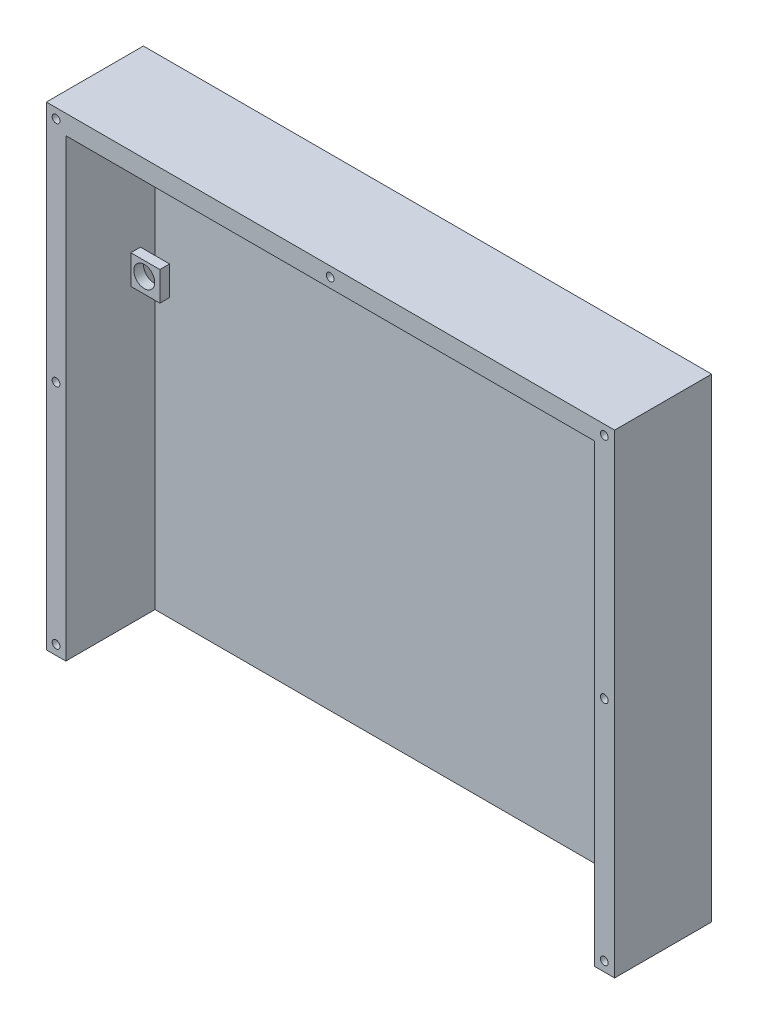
ISO-10303-21;
HEADER;
FILE_DESCRIPTION(('STEP AP214'),'2;1');
FILE_NAME('part.step','',(''),(''),'','','');
FILE_SCHEMA(('AUTOMOTIVE_DESIGN { 1 0 10303 214 1 1 1 1 }'));
ENDSEC;
DATA;
#1=APPLICATION_CONTEXT('core data for automotive mechanical design processes');
#2=APPLICATION_PROTOCOL_DEFINITION('international standard','automotive_design',2000,#1);
#3=PRODUCT_CONTEXT('',#1,'mechanical');
#4=PRODUCT('Part','Part','',(#3));
#5=PRODUCT_RELATED_PRODUCT_CATEGORY('part','',(#4));
#6=PRODUCT_DEFINITION_FORMATION('','',#4);
#7=PRODUCT_DEFINITION_CONTEXT('part definition',#1,'design');
#8=PRODUCT_DEFINITION('design','',#6,#7);
#9=PRODUCT_DEFINITION_SHAPE('','',#8);
#10=(LENGTH_UNIT() NAMED_UNIT(*) SI_UNIT(.MILLI.,.METRE.));
#11=(NAMED_UNIT(*) PLANE_ANGLE_UNIT() SI_UNIT($,.RADIAN.));
#12=(NAMED_UNIT(*) SI_UNIT($,.STERADIAN.) SOLID_ANGLE_UNIT());
#13=UNCERTAINTY_MEASURE_WITH_UNIT(LENGTH_MEASURE(1.E-05),#10,'distance_accuracy_value','');
#14=(GEOMETRIC_REPRESENTATION_CONTEXT(3) GLOBAL_UNCERTAINTY_ASSIGNED_CONTEXT((#13)) GLOBAL_UNIT_ASSIGNED_CONTEXT((#10,
#11,#12)) REPRESENTATION_CONTEXT('',''));
#15=CARTESIAN_POINT('',(0.,0.,0.));
#16=DIRECTION('',(0.,0.,1.));
#17=DIRECTION('',(1.,0.,0.));
#18=AXIS2_PLACEMENT_3D('',#15,#16,#17);
#19=CARTESIAN_POINT('',(10.,479.,0.));
#20=DIRECTION('',(0.,0.,1.));
#21=DIRECTION('',(1.,0.,0.));
#22=AXIS2_PLACEMENT_3D('',#19,#20,#21);
#23=CYLINDRICAL_SURFACE('',#22,4.);
#24=CARTESIAN_POINT('',(10.,479.,100.));
#25=DIRECTION('',(0.,0.,1.));
#26=DIRECTION('',(1.,0.,0.));
#27=AXIS2_PLACEMENT_3D('',#24,#25,#26);
#28=CIRCLE('',#27,4.);
#29=CARTESIAN_POINT('',(14.,479.,100.));
#30=VERTEX_POINT('',#29);
#31=EDGE_CURVE('E287',#30,#30,#28,.T.);
#32=ORIENTED_EDGE('',*,*,#31,.T.);
#33=EDGE_LOOP('',(#32));
#34=FACE_BOUND('',#33,.T.);
#35=CARTESIAN_POINT('',(10.,479.,4.));
#36=DIRECTION('',(0.,0.,-1.));
#37=DIRECTION('',(-1.,0.,0.));
#38=AXIS2_PLACEMENT_3D('',#35,#36,#37);
#39=CIRCLE('',#38,4.);
#40=CARTESIAN_POINT('',(6.,479.,4.));
#41=VERTEX_POINT('',#40);
#42=EDGE_CURVE('E43',#41,#41,#39,.F.);
#43=ORIENTED_EDGE('',*,*,#42,.F.);
#44=EDGE_LOOP('',(#43));
#45=FACE_BOUND('',#44,.T.);
#46=ADVANCED_FACE('F39',(#34,#45),#23,.F.);
#47=CARTESIAN_POINT('',(292.5,479.,0.));
#48=DIRECTION('',(0.,0.,1.));
#49=DIRECTION('',(1.,0.,0.));
#50=AXIS2_PLACEMENT_3D('',#47,#48,#49);
#51=CYLINDRICAL_SURFACE('',#50,3.99999999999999);
#52=CARTESIAN_POINT('',(292.5,479.,100.));
#53=DIRECTION('',(0.,0.,1.));
#54=DIRECTION('',(1.,0.,0.));
#55=AXIS2_PLACEMENT_3D('',#52,#53,#54);
#56=CIRCLE('',#55,3.99999999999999);
#57=CARTESIAN_POINT('',(296.5,479.,100.));
#58=VERTEX_POINT('',#57);
#59=EDGE_CURVE('E260',#58,#58,#56,.T.);
#60=ORIENTED_EDGE('',*,*,#59,.T.);
#61=EDGE_LOOP('',(#60));
#62=FACE_BOUND('',#61,.T.);
#63=CARTESIAN_POINT('',(292.5,479.,4.));
#64=DIRECTION('',(0.,0.,-1.));
#65=DIRECTION('',(-1.,0.,0.));
#66=AXIS2_PLACEMENT_3D('',#63,#64,#65);
#67=CIRCLE('',#66,3.99999999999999);
#68=CARTESIAN_POINT('',(288.5,479.,4.));
#69=VERTEX_POINT('',#68);
#70=EDGE_CURVE('E253',#69,#69,#67,.F.);
#71=ORIENTED_EDGE('',*,*,#70,.F.);
#72=EDGE_LOOP('',(#71));
#73=FACE_BOUND('',#72,.T.);
#74=ADVANCED_FACE('F376',(#62,#73),#51,.F.);
#75=CARTESIAN_POINT('',(575.,244.,0.));
#76=DIRECTION('',(0.,0.,1.));
#77=DIRECTION('',(1.,0.,0.));
#78=AXIS2_PLACEMENT_3D('',#75,#76,#77);
#79=CYLINDRICAL_SURFACE('',#78,3.99999999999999);
#80=CARTESIAN_POINT('',(575.,244.,100.));
#81=DIRECTION('',(0.,0.,1.));
#82=DIRECTION('',(1.,0.,0.));
#83=AXIS2_PLACEMENT_3D('',#80,#81,#82);
#84=CIRCLE('',#83,3.99999999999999);
#85=CARTESIAN_POINT('',(579.,244.,100.));
#86=VERTEX_POINT('',#85);
#87=EDGE_CURVE('E265',#86,#86,#84,.T.);
#88=ORIENTED_EDGE('',*,*,#87,.T.);
#89=EDGE_LOOP('',(#88));
#90=FACE_BOUND('',#89,.T.);
#91=CARTESIAN_POINT('',(575.,244.,4.));
#92=DIRECTION('',(0.,0.,-1.));
#93=DIRECTION('',(-1.,0.,0.));
#94=AXIS2_PLACEMENT_3D('',#91,#92,#93);
#95=CIRCLE('',#94,3.99999999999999);
#96=CARTESIAN_POINT('',(571.,244.,4.));
#97=VERTEX_POINT('',#96);
#98=EDGE_CURVE('E250',#97,#97,#95,.F.);
#99=ORIENTED_EDGE('',*,*,#98,.F.);
#100=EDGE_LOOP('',(#99));
#101=FACE_BOUND('',#100,.T.);
#102=ADVANCED_FACE('F382',(#90,#101),#79,.F.);
#103=CARTESIAN_POINT('',(575.,479.,0.));
#104=DIRECTION('',(0.,0.,1.));
#105=DIRECTION('',(1.,0.,0.));
#106=AXIS2_PLACEMENT_3D('',#103,#104,#105);
#107=CYLINDRICAL_SURFACE('',#106,3.99999999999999);
#108=CARTESIAN_POINT('',(575.,479.,100.));
#109=DIRECTION('',(0.,0.,1.));
#110=DIRECTION('',(1.,0.,0.));
#111=AXIS2_PLACEMENT_3D('',#108,#109,#110);
#112=CIRCLE('',#111,3.99999999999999);
#113=CARTESIAN_POINT('',(579.,479.,100.));
#114=VERTEX_POINT('',#113);
#115=EDGE_CURVE('E283',#114,#114,#112,.T.);
#116=ORIENTED_EDGE('',*,*,#115,.T.);
#117=EDGE_LOOP('',(#116));
#118=FACE_BOUND('',#117,.T.);
#119=CARTESIAN_POINT('',(575.,479.,4.));
#120=DIRECTION('',(0.,0.,-1.));
#121=DIRECTION('',(-1.,0.,0.));
#122=AXIS2_PLACEMENT_3D('',#119,#120,#121);
#123=CIRCLE('',#122,3.99999999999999);
#124=CARTESIAN_POINT('',(571.,479.,4.));
#125=VERTEX_POINT('',#124);
#126=EDGE_CURVE('E246',#125,#125,#123,.F.);
#127=ORIENTED_EDGE('',*,*,#126,.F.);
#128=EDGE_LOOP('',(#127));
#129=FACE_BOUND('',#128,.T.);
#130=ADVANCED_FACE('F439',(#118,#129),#107,.F.);
#131=CARTESIAN_POINT('',(10.,10.,0.));
#132=DIRECTION('',(0.,0.,1.));
#133=DIRECTION('',(1.,0.,0.));
#134=AXIS2_PLACEMENT_3D('',#131,#132,#133);
#135=CYLINDRICAL_SURFACE('',#134,4.);
#136=CARTESIAN_POINT('',(10.,10.,100.));
#137=DIRECTION('',(0.,0.,1.));
#138=DIRECTION('',(1.,0.,0.));
#139=AXIS2_PLACEMENT_3D('',#136,#137,#138);
#140=CIRCLE('',#139,4.);
#141=CARTESIAN_POINT('',(14.,10.,100.));
#142=VERTEX_POINT('',#141);
#143=EDGE_CURVE('E279',#142,#142,#140,.T.);
#144=ORIENTED_EDGE('',*,*,#143,.T.);
#145=EDGE_LOOP('',(#144));
#146=FACE_BOUND('',#145,.T.);
#147=CARTESIAN_POINT('',(10.,10.,4.));
#148=DIRECTION('',(0.,0.,-1.));
#149=DIRECTION('',(-1.,0.,0.));
#150=AXIS2_PLACEMENT_3D('',#147,#148,#149);
#151=CIRCLE('',#150,4.);
#152=CARTESIAN_POINT('',(6.,10.,4.));
#153=VERTEX_POINT('',#152);
#154=EDGE_CURVE('E242',#153,#153,#151,.F.);
#155=ORIENTED_EDGE('',*,*,#154,.F.);
#156=EDGE_LOOP('',(#155));
#157=FACE_BOUND('',#156,.T.);
#158=ADVANCED_FACE('F387',(#146,#157),#135,.F.);
#159=CARTESIAN_POINT('',(575.,10.,0.));
#160=DIRECTION('',(0.,0.,1.));
#161=DIRECTION('',(1.,0.,0.));
#162=AXIS2_PLACEMENT_3D('',#159,#160,#161);
#163=CYLINDRICAL_SURFACE('',#162,3.99999999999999);
#164=CARTESIAN_POINT('',(575.,10.,100.));
#165=DIRECTION('',(0.,0.,1.));
#166=DIRECTION('',(1.,0.,0.));
#167=AXIS2_PLACEMENT_3D('',#164,#165,#166);
#168=CIRCLE('',#167,3.99999999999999);
#169=CARTESIAN_POINT('',(579.,10.,100.));
#170=VERTEX_POINT('',#169);
#171=EDGE_CURVE('E275',#170,#170,#168,.T.);
#172=ORIENTED_EDGE('',*,*,#171,.T.);
#173=EDGE_LOOP('',(#172));
#174=FACE_BOUND('',#173,.T.);
#175=CARTESIAN_POINT('',(575.,10.,4.));
#176=DIRECTION('',(0.,0.,-1.));
#177=DIRECTION('',(-1.,0.,0.));
#178=AXIS2_PLACEMENT_3D('',#175,#176,#177);
#179=CIRCLE('',#178,3.99999999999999);
#180=CARTESIAN_POINT('',(571.,10.,4.));
#181=VERTEX_POINT('',#180);
#182=EDGE_CURVE('E237',#181,#181,#179,.F.);
#183=ORIENTED_EDGE('',*,*,#182,.F.);
#184=EDGE_LOOP('',(#183));
#185=FACE_BOUND('',#184,.T.);
#186=ADVANCED_FACE('F421',(#174,#185),#163,.F.);
#187=CARTESIAN_POINT('',(10.,244.,0.));
#188=DIRECTION('',(0.,0.,1.));
#189=DIRECTION('',(1.,0.,0.));
#190=AXIS2_PLACEMENT_3D('',#187,#188,#189);
#191=CYLINDRICAL_SURFACE('',#190,4.);
#192=CARTESIAN_POINT('',(10.,244.,100.));
#193=DIRECTION('',(0.,0.,1.));
#194=DIRECTION('',(1.,0.,0.));
#195=AXIS2_PLACEMENT_3D('',#192,#193,#194);
#196=CIRCLE('',#195,4.);
#197=CARTESIAN_POINT('',(14.,244.,100.));
#198=VERTEX_POINT('',#197);
#199=EDGE_CURVE('E271',#198,#198,#196,.T.);
#200=ORIENTED_EDGE('',*,*,#199,.T.);
#201=EDGE_LOOP('',(#200));
#202=FACE_BOUND('',#201,.T.);
#203=CARTESIAN_POINT('',(10.,244.,4.));
#204=DIRECTION('',(0.,0.,-1.));
#205=DIRECTION('',(-1.,0.,0.));
#206=AXIS2_PLACEMENT_3D('',#203,#204,#205);
#207=CIRCLE('',#206,4.);
#208=CARTESIAN_POINT('',(6.,244.,4.));
#209=VERTEX_POINT('',#208);
#210=EDGE_CURVE('E233',#209,#209,#207,.F.);
#211=ORIENTED_EDGE('',*,*,#210,.F.);
#212=EDGE_LOOP('',(#211));
#213=FACE_BOUND('',#212,.T.);
#214=ADVANCED_FACE('F415',(#202,#213),#191,.F.);
#215=CARTESIAN_POINT('',(0.,0.,100.));
#216=DIRECTION('',(0.,0.,-1.));
#217=DIRECTION('',(-1.,0.,0.));
#218=AXIS2_PLACEMENT_3D('',#215,#216,#217);
#219=PLANE('',#218);
#220=ORIENTED_EDGE('',*,*,#199,.F.);
#221=EDGE_LOOP('',(#220));
#222=FACE_BOUND('',#221,.T.);
#223=ORIENTED_EDGE('',*,*,#171,.F.);
#224=EDGE_LOOP('',(#223));
#225=FACE_BOUND('',#224,.T.);
#226=ORIENTED_EDGE('',*,*,#143,.F.);
#227=EDGE_LOOP('',(#226));
#228=FACE_BOUND('',#227,.T.);
#229=ORIENTED_EDGE('',*,*,#115,.F.);
#230=EDGE_LOOP('',(#229));
#231=FACE_BOUND('',#230,.T.);
#232=ORIENTED_EDGE('',*,*,#87,.F.);
#233=EDGE_LOOP('',(#232));
#234=FACE_BOUND('',#233,.T.);
#235=ORIENTED_EDGE('',*,*,#59,.F.);
#236=EDGE_LOOP('',(#235));
#237=FACE_BOUND('',#236,.T.);
#238=ORIENTED_EDGE('',*,*,#31,.F.);
#239=EDGE_LOOP('',(#238));
#240=FACE_BOUND('',#239,.T.);
#241=DIRECTION('',(1.,0.,0.));
#242=VECTOR('',#241,1.);
#243=CARTESIAN_POINT('',(0.,0.,100.));
#244=LINE('',#243,#242);
#245=CARTESIAN_POINT('',(0.,0.,100.));
#246=VERTEX_POINT('',#245);
#247=CARTESIAN_POINT('',(20.,0.,100.));
#248=VERTEX_POINT('',#247);
#249=EDGE_CURVE('E201',#246,#248,#244,.T.);
#250=ORIENTED_EDGE('',*,*,#249,.T.);
#251=DIRECTION('',(0.,-1.,0.));
#252=VECTOR('',#251,1.);
#253=CARTESIAN_POINT('',(19.9999999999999,469.,100.));
#254=LINE('',#253,#252);
#255=CARTESIAN_POINT('',(19.9999999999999,469.,100.));
#256=VERTEX_POINT('',#255);
#257=EDGE_CURVE('E163',#256,#248,#254,.T.);
#258=ORIENTED_EDGE('',*,*,#257,.F.);
#259=DIRECTION('',(-1.,0.,0.));
#260=VECTOR('',#259,1.);
#261=CARTESIAN_POINT('',(50.,469.,100.));
#262=LINE('',#261,#260);
#263=CARTESIAN_POINT('',(565.,469.,100.));
#264=VERTEX_POINT('',#263);
#265=EDGE_CURVE('E176',#264,#256,#262,.T.);
#266=ORIENTED_EDGE('',*,*,#265,.F.);
#267=DIRECTION('',(0.,1.,0.));
#268=VECTOR('',#267,1.);
#269=CARTESIAN_POINT('',(565.,469.,100.));
#270=LINE('',#269,#268);
#271=CARTESIAN_POINT('',(565.,0.,100.));
#272=VERTEX_POINT('',#271);
#273=EDGE_CURVE('E183',#272,#264,#270,.T.);
#274=ORIENTED_EDGE('',*,*,#273,.F.);
#275=CARTESIAN_POINT('',(585.633745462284,0.,100.));
#276=VERTEX_POINT('',#275);
#277=EDGE_CURVE('E199',#272,#276,#244,.T.);
#278=ORIENTED_EDGE('',*,*,#277,.T.);
#279=DIRECTION('',(0.,1.,0.));
#280=VECTOR('',#279,1.);
#281=CARTESIAN_POINT('',(585.633745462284,0.,100.));
#282=LINE('',#281,#280);
#283=CARTESIAN_POINT('',(585.633745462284,489.,100.));
#284=VERTEX_POINT('',#283);
#285=EDGE_CURVE('E205',#276,#284,#282,.T.);
#286=ORIENTED_EDGE('',*,*,#285,.T.);
#287=DIRECTION('',(-1.,0.,0.));
#288=VECTOR('',#287,1.);
#289=CARTESIAN_POINT('',(0.,489.,100.));
#290=LINE('',#289,#288);
#291=CARTESIAN_POINT('',(0.,489.,100.));
#292=VERTEX_POINT('',#291);
#293=EDGE_CURVE('E208',#284,#292,#290,.T.);
#294=ORIENTED_EDGE('',*,*,#293,.T.);
#295=DIRECTION('',(0.,-1.,0.));
#296=VECTOR('',#295,1.);
#297=CARTESIAN_POINT('',(0.,0.,100.));
#298=LINE('',#297,#296);
#299=EDGE_CURVE('E195',#292,#246,#298,.T.);
#300=ORIENTED_EDGE('',*,*,#299,.T.);
#301=EDGE_LOOP('',(#250,#258,#266,#274,#278,#286,#294,#300));
#302=FACE_BOUND('',#301,.T.);
#303=ADVANCED_FACE('F334',(#222,#225,#228,#231,#234,#237,#240,#302),#219,.F.);
#304=CARTESIAN_POINT('',(0.,0.,100.));
#305=DIRECTION('',(1.,0.,0.));
#306=DIRECTION('',(0.,0.,-1.));
#307=AXIS2_PLACEMENT_3D('',#304,#305,#306);
#308=PLANE('',#307);
#309=DIRECTION('',(0.,-1.,0.));
#310=VECTOR('',#309,1.);
#311=CARTESIAN_POINT('',(0.,0.,0.));
#312=LINE('',#311,#310);
#313=CARTESIAN_POINT('',(0.,489.,0.));
#314=VERTEX_POINT('',#313);
#315=CARTESIAN_POINT('',(0.,0.,0.));
#316=VERTEX_POINT('',#315);
#317=EDGE_CURVE('E192',#314,#316,#312,.T.);
#318=ORIENTED_EDGE('',*,*,#317,.T.);
#319=DIRECTION('',(0.,0.,-1.));
#320=VECTOR('',#319,1.);
#321=CARTESIAN_POINT('',(0.,0.,100.));
#322=LINE('',#321,#320);
#323=EDGE_CURVE('E11',#246,#316,#322,.T.);
#324=ORIENTED_EDGE('',*,*,#323,.F.);
#325=ORIENTED_EDGE('',*,*,#299,.F.);
#326=DIRECTION('',(0.,0.,-1.));
#327=VECTOR('',#326,1.);
#328=CARTESIAN_POINT('',(0.,489.,100.));
#329=LINE('',#328,#327);
#330=EDGE_CURVE('E211',#292,#314,#329,.T.);
#331=ORIENTED_EDGE('',*,*,#330,.T.);
#332=EDGE_LOOP('',(#318,#324,#325,#331));
#333=FACE_BOUND('',#332,.T.);
#334=ADVANCED_FACE('F41',(#333),#308,.F.);
#335=CARTESIAN_POINT('',(0.,0.,100.));
#336=DIRECTION('',(0.,1.,0.));
#337=DIRECTION('',(0.,0.,1.));
#338=AXIS2_PLACEMENT_3D('',#335,#336,#337);
#339=PLANE('',#338);
#340=DIRECTION('',(1.,0.,0.));
#341=VECTOR('',#340,1.);
#342=CARTESIAN_POINT('',(50.,0.,8.00000000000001));
#343=LINE('',#342,#341);
#344=CARTESIAN_POINT('',(20.,0.,7.99999999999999));
#345=VERTEX_POINT('',#344);
#346=CARTESIAN_POINT('',(565.,0.,8.00000000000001));
#347=VERTEX_POINT('',#346);
#348=EDGE_CURVE('E171',#345,#347,#343,.T.);
#349=ORIENTED_EDGE('',*,*,#348,.F.);
#350=DIRECTION('',(0.,0.,-1.));
#351=VECTOR('',#350,1.);
#352=CARTESIAN_POINT('',(20.,0.,100.));
#353=LINE('',#352,#351);
#354=EDGE_CURVE('E158',#248,#345,#353,.T.);
#355=ORIENTED_EDGE('',*,*,#354,.F.);
#356=ORIENTED_EDGE('',*,*,#249,.F.);
#357=ORIENTED_EDGE('',*,*,#323,.T.);
#358=DIRECTION('',(1.,0.,0.));
#359=VECTOR('',#358,1.);
#360=CARTESIAN_POINT('',(0.,0.,0.));
#361=LINE('',#360,#359);
#362=CARTESIAN_POINT('',(585.633745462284,0.,0.));
#363=VERTEX_POINT('',#362);
#364=EDGE_CURVE('E215',#316,#363,#361,.T.);
#365=ORIENTED_EDGE('',*,*,#364,.T.);
#366=DIRECTION('',(0.,0.,-1.));
#367=VECTOR('',#366,1.);
#368=CARTESIAN_POINT('',(585.633745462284,0.,100.));
#369=LINE('',#368,#367);
#370=EDGE_CURVE('E49',#276,#363,#369,.T.);
#371=ORIENTED_EDGE('',*,*,#370,.F.);
#372=ORIENTED_EDGE('',*,*,#277,.F.);
#373=DIRECTION('',(0.,0.,1.));
#374=VECTOR('',#373,1.);
#375=CARTESIAN_POINT('',(565.,0.,8.00000000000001));
#376=LINE('',#375,#374);
#377=EDGE_CURVE('E65',#347,#272,#376,.T.);
#378=ORIENTED_EDGE('',*,*,#377,.F.);
#379=EDGE_LOOP('',(#349,#355,#356,#357,#365,#371,#372,#378));
#380=FACE_BOUND('',#379,.T.);
#381=ADVANCED_FACE('F339',(#380),#339,.F.);
#382=CARTESIAN_POINT('',(585.633745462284,0.,100.));
#383=DIRECTION('',(-1.,0.,0.));
#384=DIRECTION('',(0.,0.,1.));
#385=AXIS2_PLACEMENT_3D('',#382,#383,#384);
#386=PLANE('',#385);
#387=DIRECTION('',(0.,1.,0.));
#388=VECTOR('',#387,1.);
#389=CARTESIAN_POINT('',(585.633745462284,0.,0.));
#390=LINE('',#389,#388);
#391=CARTESIAN_POINT('',(585.633745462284,489.,0.));
#392=VERTEX_POINT('',#391);
#393=EDGE_CURVE('E218',#363,#392,#390,.T.);
#394=ORIENTED_EDGE('',*,*,#393,.T.);
#395=DIRECTION('',(0.,0.,-1.));
#396=VECTOR('',#395,1.);
#397=CARTESIAN_POINT('',(585.633745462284,489.,100.));
#398=LINE('',#397,#396);
#399=EDGE_CURVE('E226',#284,#392,#398,.T.);
#400=ORIENTED_EDGE('',*,*,#399,.F.);
#401=ORIENTED_EDGE('',*,*,#285,.F.);
#402=ORIENTED_EDGE('',*,*,#370,.T.);
#403=EDGE_LOOP('',(#394,#400,#401,#402));
#404=FACE_BOUND('',#403,.T.);
#405=ADVANCED_FACE('F351',(#404),#386,.F.);
#406=CARTESIAN_POINT('',(0.,489.,100.));
#407=DIRECTION('',(0.,-1.,0.));
#408=DIRECTION('',(0.,0.,-1.));
#409=AXIS2_PLACEMENT_3D('',#406,#407,#408);
#410=PLANE('',#409);
#411=DIRECTION('',(-1.,0.,0.));
#412=VECTOR('',#411,1.);
#413=CARTESIAN_POINT('',(0.,489.,0.));
#414=LINE('',#413,#412);
#415=EDGE_CURVE('E200',#392,#314,#414,.T.);
#416=ORIENTED_EDGE('',*,*,#415,.T.);
#417=ORIENTED_EDGE('',*,*,#330,.F.);
#418=ORIENTED_EDGE('',*,*,#293,.F.);
#419=ORIENTED_EDGE('',*,*,#399,.T.);
#420=EDGE_LOOP('',(#416,#417,#418,#419));
#421=FACE_BOUND('',#420,.T.);
#422=ADVANCED_FACE('F355',(#421),#410,.F.);
#423=CARTESIAN_POINT('',(0.,0.,0.));
#424=DIRECTION('',(0.,0.,-1.));
#425=DIRECTION('',(-1.,0.,0.));
#426=AXIS2_PLACEMENT_3D('',#423,#424,#425);
#427=PLANE('',#426);
#428=CARTESIAN_POINT('',(292.5,479.,0.));
#429=DIRECTION('',(0.,0.,-1.));
#430=DIRECTION('',(-1.,0.,0.));
#431=AXIS2_PLACEMENT_3D('',#428,#429,#430);
#432=CIRCLE('',#431,5.99999999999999);
#433=CARTESIAN_POINT('',(286.5,479.,0.));
#434=VERTEX_POINT('',#433);
#435=EDGE_CURVE('E523',#434,#434,#432,.T.);
#436=ORIENTED_EDGE('',*,*,#435,.F.);
#437=EDGE_LOOP('',(#436));
#438=FACE_BOUND('',#437,.T.);
#439=CARTESIAN_POINT('',(10.,479.,0.));
#440=DIRECTION('',(0.,0.,-1.));
#441=DIRECTION('',(-1.,0.,0.));
#442=AXIS2_PLACEMENT_3D('',#439,#440,#441);
#443=CIRCLE('',#442,6.);
#444=CARTESIAN_POINT('',(4.,479.,0.));
#445=VERTEX_POINT('',#444);
#446=EDGE_CURVE('E524',#445,#445,#443,.T.);
#447=ORIENTED_EDGE('',*,*,#446,.F.);
#448=EDGE_LOOP('',(#447));
#449=FACE_BOUND('',#448,.T.);
#450=CARTESIAN_POINT('',(575.,244.,0.));
#451=DIRECTION('',(0.,0.,-1.));
#452=DIRECTION('',(-1.,0.,0.));
#453=AXIS2_PLACEMENT_3D('',#450,#451,#452);
#454=CIRCLE('',#453,5.99999999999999);
#455=CARTESIAN_POINT('',(569.,244.,0.));
#456=VERTEX_POINT('',#455);
#457=EDGE_CURVE('E538',#456,#456,#454,.T.);
#458=ORIENTED_EDGE('',*,*,#457,.F.);
#459=EDGE_LOOP('',(#458));
#460=FACE_BOUND('',#459,.T.);
#461=CARTESIAN_POINT('',(575.,10.,0.));
#462=DIRECTION('',(0.,0.,-1.));
#463=DIRECTION('',(-1.,0.,0.));
#464=AXIS2_PLACEMENT_3D('',#461,#462,#463);
#465=CIRCLE('',#464,5.99999999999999);
#466=CARTESIAN_POINT('',(569.,10.,0.));
#467=VERTEX_POINT('',#466);
#468=EDGE_CURVE('E546',#467,#467,#465,.T.);
#469=ORIENTED_EDGE('',*,*,#468,.F.);
#470=EDGE_LOOP('',(#469));
#471=FACE_BOUND('',#470,.T.);
#472=CARTESIAN_POINT('',(10.,244.,0.));
#473=DIRECTION('',(0.,0.,-1.));
#474=DIRECTION('',(-1.,0.,0.));
#475=AXIS2_PLACEMENT_3D('',#472,#473,#474);
#476=CIRCLE('',#475,6.);
#477=CARTESIAN_POINT('',(4.,244.,0.));
#478=VERTEX_POINT('',#477);
#479=EDGE_CURVE('E569',#478,#478,#476,.T.);
#480=ORIENTED_EDGE('',*,*,#479,.F.);
#481=EDGE_LOOP('',(#480));
#482=FACE_BOUND('',#481,.T.);
#483=CARTESIAN_POINT('',(10.,10.,0.));
#484=DIRECTION('',(0.,0.,-1.));
#485=DIRECTION('',(-1.,0.,0.));
#486=AXIS2_PLACEMENT_3D('',#483,#484,#485);
#487=CIRCLE('',#486,6.);
#488=CARTESIAN_POINT('',(4.,10.,0.));
#489=VERTEX_POINT('',#488);
#490=EDGE_CURVE('E562',#489,#489,#487,.T.);
#491=ORIENTED_EDGE('',*,*,#490,.F.);
#492=EDGE_LOOP('',(#491));
#493=FACE_BOUND('',#492,.T.);
#494=CARTESIAN_POINT('',(575.,479.,0.));
#495=DIRECTION('',(0.,0.,-1.));
#496=DIRECTION('',(-1.,0.,0.));
#497=AXIS2_PLACEMENT_3D('',#494,#495,#496);
#498=CIRCLE('',#497,5.99999999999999);
#499=CARTESIAN_POINT('',(569.,479.,0.));
#500=VERTEX_POINT('',#499);
#501=EDGE_CURVE('E553',#500,#500,#498,.T.);
#502=ORIENTED_EDGE('',*,*,#501,.F.);
#503=EDGE_LOOP('',(#502));
#504=FACE_BOUND('',#503,.T.);
#505=ORIENTED_EDGE('',*,*,#317,.F.);
#506=ORIENTED_EDGE('',*,*,#415,.F.);
#507=ORIENTED_EDGE('',*,*,#393,.F.);
#508=ORIENTED_EDGE('',*,*,#364,.F.);
#509=EDGE_LOOP('',(#505,#506,#507,#508));
#510=FACE_BOUND('',#509,.T.);
#511=ADVANCED_FACE('F360',(#438,#449,#460,#471,#482,#493,#504,#510),#427,.T.);
#512=CARTESIAN_POINT('',(50.,469.,8.00000000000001));
#513=DIRECTION('',(-1.,0.,0.));
#514=DIRECTION('',(0.,-1.,0.));
#515=AXIS2_PLACEMENT_3D('',#512,#513,#514);
#516=PLANE('',#515);
#517=DIRECTION('',(0.,0.,1.));
#518=VECTOR('',#517,1.);
#519=CARTESIAN_POINT('',(50.,301.,100.));
#520=LINE('',#519,#518);
#521=CARTESIAN_POINT('',(50.,301.,23.));
#522=VERTEX_POINT('',#521);
#523=CARTESIAN_POINT('',(50.,301.,33.));
#524=VERTEX_POINT('',#523);
#525=EDGE_CURVE('E166',#522,#524,#520,.T.);
#526=ORIENTED_EDGE('',*,*,#525,.F.);
#527=DIRECTION('',(0.,-1.,0.));
#528=VECTOR('',#527,1.);
#529=CARTESIAN_POINT('',(50.,331.,23.));
#530=LINE('',#529,#528);
#531=CARTESIAN_POINT('',(50.,331.,23.));
#532=VERTEX_POINT('',#531);
#533=EDGE_CURVE('E138',#532,#522,#530,.T.);
#534=ORIENTED_EDGE('',*,*,#533,.F.);
#535=DIRECTION('',(0.,0.,-1.));
#536=VECTOR('',#535,1.);
#537=CARTESIAN_POINT('',(50.,331.,100.));
#538=LINE('',#537,#536);
#539=CARTESIAN_POINT('',(50.,331.,33.));
#540=VERTEX_POINT('',#539);
#541=EDGE_CURVE('E157',#540,#532,#538,.T.);
#542=ORIENTED_EDGE('',*,*,#541,.F.);
#543=DIRECTION('',(0.,1.,0.));
#544=VECTOR('',#543,1.);
#545=CARTESIAN_POINT('',(50.,331.,33.));
#546=LINE('',#545,#544);
#547=EDGE_CURVE('E299',#524,#540,#546,.T.);
#548=ORIENTED_EDGE('',*,*,#547,.F.);
#549=EDGE_LOOP('',(#526,#534,#542,#548));
#550=FACE_BOUND('',#549,.T.);
#551=ADVANCED_FACE('F362',(#550),#516,.F.);
#552=CARTESIAN_POINT('',(50.,469.,8.00000000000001));
#553=DIRECTION('',(0.,1.,0.));
#554=DIRECTION('',(0.,0.,1.));
#555=AXIS2_PLACEMENT_3D('',#552,#553,#554);
#556=PLANE('',#555);
#557=ORIENTED_EDGE('',*,*,#265,.T.);
#558=DIRECTION('',(0.,0.,1.));
#559=VECTOR('',#558,1.);
#560=CARTESIAN_POINT('',(19.9999999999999,469.,100.));
#561=LINE('',#560,#559);
#562=CARTESIAN_POINT('',(19.9999999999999,469.,7.99999999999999));
#563=VERTEX_POINT('',#562);
#564=EDGE_CURVE('E186',#563,#256,#561,.T.);
#565=ORIENTED_EDGE('',*,*,#564,.F.);
#566=DIRECTION('',(-1.,0.,0.));
#567=VECTOR('',#566,1.);
#568=CARTESIAN_POINT('',(50.,469.,8.00000000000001));
#569=LINE('',#568,#567);
#570=CARTESIAN_POINT('',(565.,469.,8.00000000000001));
#571=VERTEX_POINT('',#570);
#572=EDGE_CURVE('E180',#571,#563,#569,.T.);
#573=ORIENTED_EDGE('',*,*,#572,.F.);
#574=DIRECTION('',(0.,0.,1.));
#575=VECTOR('',#574,1.);
#576=CARTESIAN_POINT('',(565.,469.,8.00000000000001));
#577=LINE('',#576,#575);
#578=EDGE_CURVE('E189',#571,#264,#577,.T.);
#579=ORIENTED_EDGE('',*,*,#578,.T.);
#580=EDGE_LOOP('',(#557,#565,#573,#579));
#581=FACE_BOUND('',#580,.T.);
#582=ADVANCED_FACE('F343',(#581),#556,.F.);
#583=CARTESIAN_POINT('',(565.,469.,8.00000000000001));
#584=DIRECTION('',(1.,0.,0.));
#585=DIRECTION('',(0.,1.,0.));
#586=AXIS2_PLACEMENT_3D('',#583,#584,#585);
#587=PLANE('',#586);
#588=ORIENTED_EDGE('',*,*,#273,.T.);
#589=ORIENTED_EDGE('',*,*,#578,.F.);
#590=DIRECTION('',(0.,1.,0.));
#591=VECTOR('',#590,1.);
#592=CARTESIAN_POINT('',(565.,469.,8.00000000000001));
#593=LINE('',#592,#591);
#594=EDGE_CURVE('E175',#347,#571,#593,.T.);
#595=ORIENTED_EDGE('',*,*,#594,.F.);
#596=ORIENTED_EDGE('',*,*,#377,.T.);
#597=EDGE_LOOP('',(#588,#589,#595,#596));
#598=FACE_BOUND('',#597,.T.);
#599=ADVANCED_FACE('F344',(#598),#587,.F.);
#600=CARTESIAN_POINT('',(0.,0.,8.00000000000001));
#601=DIRECTION('',(0.,0.,1.));
#602=DIRECTION('',(1.,0.,0.));
#603=AXIS2_PLACEMENT_3D('',#600,#601,#602);
#604=PLANE('',#603);
#605=ORIENTED_EDGE('',*,*,#572,.T.);
#606=DIRECTION('',(0.,1.,0.));
#607=VECTOR('',#606,1.);
#608=CARTESIAN_POINT('',(19.9999999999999,469.,7.99999999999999));
#609=LINE('',#608,#607);
#610=EDGE_CURVE('E321',#345,#563,#609,.T.);
#611=ORIENTED_EDGE('',*,*,#610,.F.);
#612=ORIENTED_EDGE('',*,*,#348,.T.);
#613=ORIENTED_EDGE('',*,*,#594,.T.);
#614=EDGE_LOOP('',(#605,#611,#612,#613));
#615=FACE_BOUND('',#614,.T.);
#616=ADVANCED_FACE('F342',(#615),#604,.T.);
#617=CARTESIAN_POINT('',(20.,301.,100.));
#618=DIRECTION('',(0.,1.,0.));
#619=DIRECTION('',(-1.,0.,0.));
#620=AXIS2_PLACEMENT_3D('',#617,#618,#619);
#621=PLANE('',#620);
#622=DIRECTION('',(0.,0.,1.));
#623=VECTOR('',#622,1.);
#624=CARTESIAN_POINT('',(20.,301.,100.));
#625=LINE('',#624,#623);
#626=CARTESIAN_POINT('',(20.,301.,23.));
#627=VERTEX_POINT('',#626);
#628=CARTESIAN_POINT('',(20.,301.,33.));
#629=VERTEX_POINT('',#628);
#630=EDGE_CURVE('E148',#627,#629,#625,.T.);
#631=ORIENTED_EDGE('',*,*,#630,.F.);
#632=DIRECTION('',(1.,0.,0.));
#633=VECTOR('',#632,1.);
#634=CARTESIAN_POINT('',(20.,301.,23.));
#635=LINE('',#634,#633);
#636=EDGE_CURVE('E132',#627,#522,#635,.T.);
#637=ORIENTED_EDGE('',*,*,#636,.T.);
#638=ORIENTED_EDGE('',*,*,#525,.T.);
#639=DIRECTION('',(1.,0.,0.));
#640=VECTOR('',#639,1.);
#641=CARTESIAN_POINT('',(20.,301.,33.));
#642=LINE('',#641,#640);
#643=EDGE_CURVE('E155',#629,#524,#642,.T.);
#644=ORIENTED_EDGE('',*,*,#643,.F.);
#645=EDGE_LOOP('',(#631,#637,#638,#644));
#646=FACE_BOUND('',#645,.T.);
#647=ADVANCED_FACE('F154',(#646),#621,.F.);
#648=CARTESIAN_POINT('',(20.,331.,100.));
#649=DIRECTION('',(0.,-1.,0.));
#650=DIRECTION('',(1.,0.,0.));
#651=AXIS2_PLACEMENT_3D('',#648,#649,#650);
#652=PLANE('',#651);
#653=ORIENTED_EDGE('',*,*,#541,.T.);
#654=DIRECTION('',(1.,0.,0.));
#655=VECTOR('',#654,1.);
#656=CARTESIAN_POINT('',(20.,331.,23.));
#657=LINE('',#656,#655);
#658=CARTESIAN_POINT('',(20.,331.,23.));
#659=VERTEX_POINT('',#658);
#660=EDGE_CURVE('E144',#659,#532,#657,.T.);
#661=ORIENTED_EDGE('',*,*,#660,.F.);
#662=DIRECTION('',(0.,0.,-1.));
#663=VECTOR('',#662,1.);
#664=CARTESIAN_POINT('',(20.,331.,100.));
#665=LINE('',#664,#663);
#666=CARTESIAN_POINT('',(20.,331.,33.));
#667=VERTEX_POINT('',#666);
#668=EDGE_CURVE('E150',#667,#659,#665,.T.);
#669=ORIENTED_EDGE('',*,*,#668,.F.);
#670=DIRECTION('',(1.,0.,0.));
#671=VECTOR('',#670,1.);
#672=CARTESIAN_POINT('',(20.,331.,33.));
#673=LINE('',#672,#671);
#674=EDGE_CURVE('E305',#667,#540,#673,.T.);
#675=ORIENTED_EDGE('',*,*,#674,.T.);
#676=EDGE_LOOP('',(#653,#661,#669,#675));
#677=FACE_BOUND('',#676,.T.);
#678=ADVANCED_FACE('F403',(#677),#652,.F.);
#679=CARTESIAN_POINT('',(20.,0.,0.));
#680=DIRECTION('',(1.,0.,0.));
#681=DIRECTION('',(0.,1.,0.));
#682=AXIS2_PLACEMENT_3D('',#679,#680,#681);
#683=PLANE('',#682);
#684=DIRECTION('',(0.,-1.,0.));
#685=VECTOR('',#684,1.);
#686=CARTESIAN_POINT('',(20.,331.,23.));
#687=LINE('',#686,#685);
#688=EDGE_CURVE('E135',#659,#627,#687,.T.);
#689=ORIENTED_EDGE('',*,*,#688,.T.);
#690=ORIENTED_EDGE('',*,*,#630,.T.);
#691=DIRECTION('',(0.,1.,0.));
#692=VECTOR('',#691,1.);
#693=CARTESIAN_POINT('',(20.,331.,33.));
#694=LINE('',#693,#692);
#695=EDGE_CURVE('E57',#629,#667,#694,.T.);
#696=ORIENTED_EDGE('',*,*,#695,.T.);
#697=ORIENTED_EDGE('',*,*,#668,.T.);
#698=EDGE_LOOP('',(#689,#690,#696,#697));
#699=FACE_BOUND('',#698,.T.);
#700=ORIENTED_EDGE('',*,*,#257,.T.);
#701=ORIENTED_EDGE('',*,*,#354,.T.);
#702=ORIENTED_EDGE('',*,*,#610,.T.);
#703=ORIENTED_EDGE('',*,*,#564,.T.);
#704=EDGE_LOOP('',(#700,#701,#702,#703));
#705=FACE_BOUND('',#704,.T.);
#706=ADVANCED_FACE('F146',(#699,#705),#683,.T.);
#707=CARTESIAN_POINT('',(20.,331.,33.));
#708=DIRECTION('',(0.,0.,-1.));
#709=DIRECTION('',(-1.,0.,0.));
#710=AXIS2_PLACEMENT_3D('',#707,#708,#709);
#711=PLANE('',#710);
#712=CARTESIAN_POINT('',(33.9116327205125,316.746982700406,33.));
#713=DIRECTION('',(0.,0.,1.));
#714=DIRECTION('',(1.,0.,0.));
#715=AXIS2_PLACEMENT_3D('',#712,#713,#714);
#716=CIRCLE('',#715,10.7922963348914);
#717=CARTESIAN_POINT('',(44.7039290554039,316.746982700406,33.));
#718=VERTEX_POINT('',#717);
#719=EDGE_CURVE('E294',#718,#718,#716,.T.);
#720=ORIENTED_EDGE('',*,*,#719,.F.);
#721=EDGE_LOOP('',(#720));
#722=FACE_BOUND('',#721,.T.);
#723=ORIENTED_EDGE('',*,*,#547,.T.);
#724=ORIENTED_EDGE('',*,*,#674,.F.);
#725=ORIENTED_EDGE('',*,*,#695,.F.);
#726=ORIENTED_EDGE('',*,*,#643,.T.);
#727=EDGE_LOOP('',(#723,#724,#725,#726));
#728=FACE_BOUND('',#727,.T.);
#729=ADVANCED_FACE('F396',(#722,#728),#711,.F.);
#730=CARTESIAN_POINT('',(20.,331.,23.));
#731=DIRECTION('',(0.,0.,1.));
#732=DIRECTION('',(1.,0.,0.));
#733=AXIS2_PLACEMENT_3D('',#730,#731,#732);
#734=PLANE('',#733);
#735=CARTESIAN_POINT('',(33.9116327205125,316.746982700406,23.));
#736=DIRECTION('',(0.,0.,1.));
#737=DIRECTION('',(1.,0.,0.));
#738=AXIS2_PLACEMENT_3D('',#735,#736,#737);
#739=CIRCLE('',#738,10.7922963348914);
#740=CARTESIAN_POINT('',(44.7039290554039,316.746982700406,23.));
#741=VERTEX_POINT('',#740);
#742=EDGE_CURVE('E295',#741,#741,#739,.T.);
#743=ORIENTED_EDGE('',*,*,#742,.T.);
#744=EDGE_LOOP('',(#743));
#745=FACE_BOUND('',#744,.T.);
#746=ORIENTED_EDGE('',*,*,#533,.T.);
#747=ORIENTED_EDGE('',*,*,#636,.F.);
#748=ORIENTED_EDGE('',*,*,#688,.F.);
#749=ORIENTED_EDGE('',*,*,#660,.T.);
#750=EDGE_LOOP('',(#746,#747,#748,#749));
#751=FACE_BOUND('',#750,.T.);
#752=ADVANCED_FACE('F134',(#745,#751),#734,.F.);
#753=CARTESIAN_POINT('',(33.9116327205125,316.746982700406,23.));
#754=DIRECTION('',(0.,0.,1.));
#755=DIRECTION('',(1.,0.,0.));
#756=AXIS2_PLACEMENT_3D('',#753,#754,#755);
#757=CYLINDRICAL_SURFACE('',#756,10.7922963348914);
#758=ORIENTED_EDGE('',*,*,#742,.F.);
#759=EDGE_LOOP('',(#758));
#760=FACE_BOUND('',#759,.T.);
#761=ORIENTED_EDGE('',*,*,#719,.T.);
#762=EDGE_LOOP('',(#761));
#763=FACE_BOUND('',#762,.T.);
#764=ADVANCED_FACE('F389',(#760,#763),#757,.F.);
#765=CARTESIAN_POINT('',(10.,244.,4.));
#766=DIRECTION('',(0.,0.,-1.));
#767=DIRECTION('',(-1.,0.,0.));
#768=AXIS2_PLACEMENT_3D('',#765,#766,#767);
#769=PLANE('',#768);
#770=CARTESIAN_POINT('',(10.,244.,4.));
#771=DIRECTION('',(0.,0.,-1.));
#772=DIRECTION('',(-1.,0.,0.));
#773=AXIS2_PLACEMENT_3D('',#770,#771,#772);
#774=CIRCLE('',#773,6.);
#775=CARTESIAN_POINT('',(4.,244.,4.));
#776=VERTEX_POINT('',#775);
#777=EDGE_CURVE('E550',#776,#776,#774,.T.);
#778=ORIENTED_EDGE('',*,*,#777,.T.);
#779=EDGE_LOOP('',(#778));
#780=FACE_BOUND('',#779,.T.);
#781=ORIENTED_EDGE('',*,*,#210,.T.);
#782=EDGE_LOOP('',(#781));
#783=FACE_BOUND('',#782,.T.);
#784=ADVANCED_FACE('F392',(#780,#783),#769,.T.);
#785=CARTESIAN_POINT('',(10.,244.,4.));
#786=DIRECTION('',(0.,0.,-1.));
#787=DIRECTION('',(-1.,0.,0.));
#788=AXIS2_PLACEMENT_3D('',#785,#786,#787);
#789=CYLINDRICAL_SURFACE('',#788,6.);
#790=ORIENTED_EDGE('',*,*,#777,.F.);
#791=EDGE_LOOP('',(#790));
#792=FACE_BOUND('',#791,.T.);
#793=ORIENTED_EDGE('',*,*,#479,.T.);
#794=EDGE_LOOP('',(#793));
#795=FACE_BOUND('',#794,.T.);
#796=ADVANCED_FACE('F468',(#792,#795),#789,.F.);
#797=CARTESIAN_POINT('',(575.,10.,4.));
#798=DIRECTION('',(0.,0.,-1.));
#799=DIRECTION('',(-1.,0.,0.));
#800=AXIS2_PLACEMENT_3D('',#797,#798,#799);
#801=PLANE('',#800);
#802=CARTESIAN_POINT('',(575.,10.,4.));
#803=DIRECTION('',(0.,0.,-1.));
#804=DIRECTION('',(-1.,0.,0.));
#805=AXIS2_PLACEMENT_3D('',#802,#803,#804);
#806=CIRCLE('',#805,5.99999999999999);
#807=CARTESIAN_POINT('',(569.,10.,4.));
#808=VERTEX_POINT('',#807);
#809=EDGE_CURVE('E542',#808,#808,#806,.T.);
#810=ORIENTED_EDGE('',*,*,#809,.T.);
#811=EDGE_LOOP('',(#810));
#812=FACE_BOUND('',#811,.T.);
#813=ORIENTED_EDGE('',*,*,#182,.T.);
#814=EDGE_LOOP('',(#813));
#815=FACE_BOUND('',#814,.T.);
#816=ADVANCED_FACE('F464',(#812,#815),#801,.T.);
#817=CARTESIAN_POINT('',(575.,10.,4.));
#818=DIRECTION('',(0.,0.,-1.));
#819=DIRECTION('',(-1.,0.,0.));
#820=AXIS2_PLACEMENT_3D('',#817,#818,#819);
#821=CYLINDRICAL_SURFACE('',#820,5.99999999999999);
#822=ORIENTED_EDGE('',*,*,#809,.F.);
#823=EDGE_LOOP('',(#822));
#824=FACE_BOUND('',#823,.T.);
#825=ORIENTED_EDGE('',*,*,#468,.T.);
#826=EDGE_LOOP('',(#825));
#827=FACE_BOUND('',#826,.T.);
#828=ADVANCED_FACE('F467',(#824,#827),#821,.F.);
#829=CARTESIAN_POINT('',(10.,10.,4.));
#830=DIRECTION('',(0.,0.,-1.));
#831=DIRECTION('',(-1.,0.,0.));
#832=AXIS2_PLACEMENT_3D('',#829,#830,#831);
#833=PLANE('',#832);
#834=CARTESIAN_POINT('',(10.,10.,4.));
#835=DIRECTION('',(0.,0.,-1.));
#836=DIRECTION('',(-1.,0.,0.));
#837=AXIS2_PLACEMENT_3D('',#834,#835,#836);
#838=CIRCLE('',#837,6.);
#839=CARTESIAN_POINT('',(4.,10.,4.));
#840=VERTEX_POINT('',#839);
#841=EDGE_CURVE('E566',#840,#840,#838,.T.);
#842=ORIENTED_EDGE('',*,*,#841,.T.);
#843=EDGE_LOOP('',(#842));
#844=FACE_BOUND('',#843,.T.);
#845=ORIENTED_EDGE('',*,*,#154,.T.);
#846=EDGE_LOOP('',(#845));
#847=FACE_BOUND('',#846,.T.);
#848=ADVANCED_FACE('F472',(#844,#847),#833,.T.);
#849=CARTESIAN_POINT('',(10.,10.,4.));
#850=DIRECTION('',(0.,0.,-1.));
#851=DIRECTION('',(-1.,0.,0.));
#852=AXIS2_PLACEMENT_3D('',#849,#850,#851);
#853=CYLINDRICAL_SURFACE('',#852,6.);
#854=ORIENTED_EDGE('',*,*,#841,.F.);
#855=EDGE_LOOP('',(#854));
#856=FACE_BOUND('',#855,.T.);
#857=ORIENTED_EDGE('',*,*,#490,.T.);
#858=EDGE_LOOP('',(#857));
#859=FACE_BOUND('',#858,.T.);
#860=ADVANCED_FACE('F475',(#856,#859),#853,.F.);
#861=CARTESIAN_POINT('',(575.,479.,4.));
#862=DIRECTION('',(0.,0.,-1.));
#863=DIRECTION('',(-1.,0.,0.));
#864=AXIS2_PLACEMENT_3D('',#861,#862,#863);
#865=PLANE('',#864);
#866=CARTESIAN_POINT('',(575.,479.,4.));
#867=DIRECTION('',(0.,0.,-1.));
#868=DIRECTION('',(-1.,0.,0.));
#869=AXIS2_PLACEMENT_3D('',#866,#867,#868);
#870=CIRCLE('',#869,5.99999999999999);
#871=CARTESIAN_POINT('',(569.,479.,4.));
#872=VERTEX_POINT('',#871);
#873=EDGE_CURVE('E238',#872,#872,#870,.T.);
#874=ORIENTED_EDGE('',*,*,#873,.T.);
#875=EDGE_LOOP('',(#874));
#876=FACE_BOUND('',#875,.T.);
#877=ORIENTED_EDGE('',*,*,#126,.T.);
#878=EDGE_LOOP('',(#877));
#879=FACE_BOUND('',#878,.T.);
#880=ADVANCED_FACE('F456',(#876,#879),#865,.T.);
#881=CARTESIAN_POINT('',(575.,479.,4.));
#882=DIRECTION('',(0.,0.,-1.));
#883=DIRECTION('',(-1.,0.,0.));
#884=AXIS2_PLACEMENT_3D('',#881,#882,#883);
#885=CYLINDRICAL_SURFACE('',#884,5.99999999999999);
#886=ORIENTED_EDGE('',*,*,#873,.F.);
#887=EDGE_LOOP('',(#886));
#888=FACE_BOUND('',#887,.T.);
#889=ORIENTED_EDGE('',*,*,#501,.T.);
#890=EDGE_LOOP('',(#889));
#891=FACE_BOUND('',#890,.T.);
#892=ADVANCED_FACE('F446',(#888,#891),#885,.F.);
#893=CARTESIAN_POINT('',(575.,244.,4.));
#894=DIRECTION('',(0.,0.,-1.));
#895=DIRECTION('',(-1.,0.,0.));
#896=AXIS2_PLACEMENT_3D('',#893,#894,#895);
#897=PLANE('',#896);
#898=CARTESIAN_POINT('',(575.,244.,4.));
#899=DIRECTION('',(0.,0.,-1.));
#900=DIRECTION('',(-1.,0.,0.));
#901=AXIS2_PLACEMENT_3D('',#898,#899,#900);
#902=CIRCLE('',#901,5.99999999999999);
#903=CARTESIAN_POINT('',(569.,244.,4.));
#904=VERTEX_POINT('',#903);
#905=EDGE_CURVE('E532',#904,#904,#902,.T.);
#906=ORIENTED_EDGE('',*,*,#905,.T.);
#907=EDGE_LOOP('',(#906));
#908=FACE_BOUND('',#907,.T.);
#909=ORIENTED_EDGE('',*,*,#98,.T.);
#910=EDGE_LOOP('',(#909));
#911=FACE_BOUND('',#910,.T.);
#912=ADVANCED_FACE('F443',(#908,#911),#897,.T.);
#913=CARTESIAN_POINT('',(575.,244.,4.));
#914=DIRECTION('',(0.,0.,-1.));
#915=DIRECTION('',(-1.,0.,0.));
#916=AXIS2_PLACEMENT_3D('',#913,#914,#915);
#917=CYLINDRICAL_SURFACE('',#916,5.99999999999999);
#918=ORIENTED_EDGE('',*,*,#905,.F.);
#919=EDGE_LOOP('',(#918));
#920=FACE_BOUND('',#919,.T.);
#921=ORIENTED_EDGE('',*,*,#457,.T.);
#922=EDGE_LOOP('',(#921));
#923=FACE_BOUND('',#922,.T.);
#924=ADVANCED_FACE('F445',(#920,#923),#917,.F.);
#925=CARTESIAN_POINT('',(292.5,479.,4.));
#926=DIRECTION('',(0.,0.,-1.));
#927=DIRECTION('',(-1.,0.,0.));
#928=AXIS2_PLACEMENT_3D('',#925,#926,#927);
#929=PLANE('',#928);
#930=CARTESIAN_POINT('',(292.5,479.,4.));
#931=DIRECTION('',(0.,0.,-1.));
#932=DIRECTION('',(-1.,0.,0.));
#933=AXIS2_PLACEMENT_3D('',#930,#931,#932);
#934=CIRCLE('',#933,5.99999999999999);
#935=CARTESIAN_POINT('',(286.5,479.,4.));
#936=VERTEX_POINT('',#935);
#937=EDGE_CURVE('E529',#936,#936,#934,.T.);
#938=ORIENTED_EDGE('',*,*,#937,.T.);
#939=EDGE_LOOP('',(#938));
#940=FACE_BOUND('',#939,.T.);
#941=ORIENTED_EDGE('',*,*,#70,.T.);
#942=EDGE_LOOP('',(#941));
#943=FACE_BOUND('',#942,.T.);
#944=ADVANCED_FACE('F453',(#940,#943),#929,.T.);
#945=CARTESIAN_POINT('',(292.5,479.,4.));
#946=DIRECTION('',(0.,0.,-1.));
#947=DIRECTION('',(-1.,0.,0.));
#948=AXIS2_PLACEMENT_3D('',#945,#946,#947);
#949=CYLINDRICAL_SURFACE('',#948,5.99999999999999);
#950=ORIENTED_EDGE('',*,*,#937,.F.);
#951=EDGE_LOOP('',(#950));
#952=FACE_BOUND('',#951,.T.);
#953=ORIENTED_EDGE('',*,*,#435,.T.);
#954=EDGE_LOOP('',(#953));
#955=FACE_BOUND('',#954,.T.);
#956=ADVANCED_FACE('F508',(#952,#955),#949,.F.);
#957=CARTESIAN_POINT('',(10.,479.,4.));
#958=DIRECTION('',(0.,0.,-1.));
#959=DIRECTION('',(-1.,0.,0.));
#960=AXIS2_PLACEMENT_3D('',#957,#958,#959);
#961=PLANE('',#960);
#962=CARTESIAN_POINT('',(10.,479.,4.));
#963=DIRECTION('',(0.,0.,-1.));
#964=DIRECTION('',(-1.,0.,0.));
#965=AXIS2_PLACEMENT_3D('',#962,#963,#964);
#966=CIRCLE('',#965,6.);
#967=CARTESIAN_POINT('',(4.,479.,4.));
#968=VERTEX_POINT('',#967);
#969=EDGE_CURVE('E521',#968,#968,#966,.T.);
#970=ORIENTED_EDGE('',*,*,#969,.T.);
#971=EDGE_LOOP('',(#970));
#972=FACE_BOUND('',#971,.T.);
#973=ORIENTED_EDGE('',*,*,#42,.T.);
#974=EDGE_LOOP('',(#973));
#975=FACE_BOUND('',#974,.T.);
#976=ADVANCED_FACE('F511',(#972,#975),#961,.T.);
#977=CARTESIAN_POINT('',(10.,479.,4.));
#978=DIRECTION('',(0.,0.,-1.));
#979=DIRECTION('',(-1.,0.,0.));
#980=AXIS2_PLACEMENT_3D('',#977,#978,#979);
#981=CYLINDRICAL_SURFACE('',#980,6.);
#982=ORIENTED_EDGE('',*,*,#969,.F.);
#983=EDGE_LOOP('',(#982));
#984=FACE_BOUND('',#983,.T.);
#985=ORIENTED_EDGE('',*,*,#446,.T.);
#986=EDGE_LOOP('',(#985));
#987=FACE_BOUND('',#986,.T.);
#988=ADVANCED_FACE('F461',(#984,#987),#981,.F.);
#989=CLOSED_SHELL('',(#46,#74,#102,#130,#158,#186,#214,#303,#334,#381,#405,#422,#511,#551,#582,
#599,#616,#647,#678,#706,#729,#752,#764,#784,#796,#816,#828,#848,#860,#880,#892,#912,#924,#944,
#956,#976,#988));
#990=MANIFOLD_SOLID_BREP('B2',#989);
#991=ADVANCED_BREP_SHAPE_REPRESENTATION('',(#18,#990),#14);
#992=SHAPE_DEFINITION_REPRESENTATION(#9,#991);
ENDSEC;
END-ISO-10303-21;
